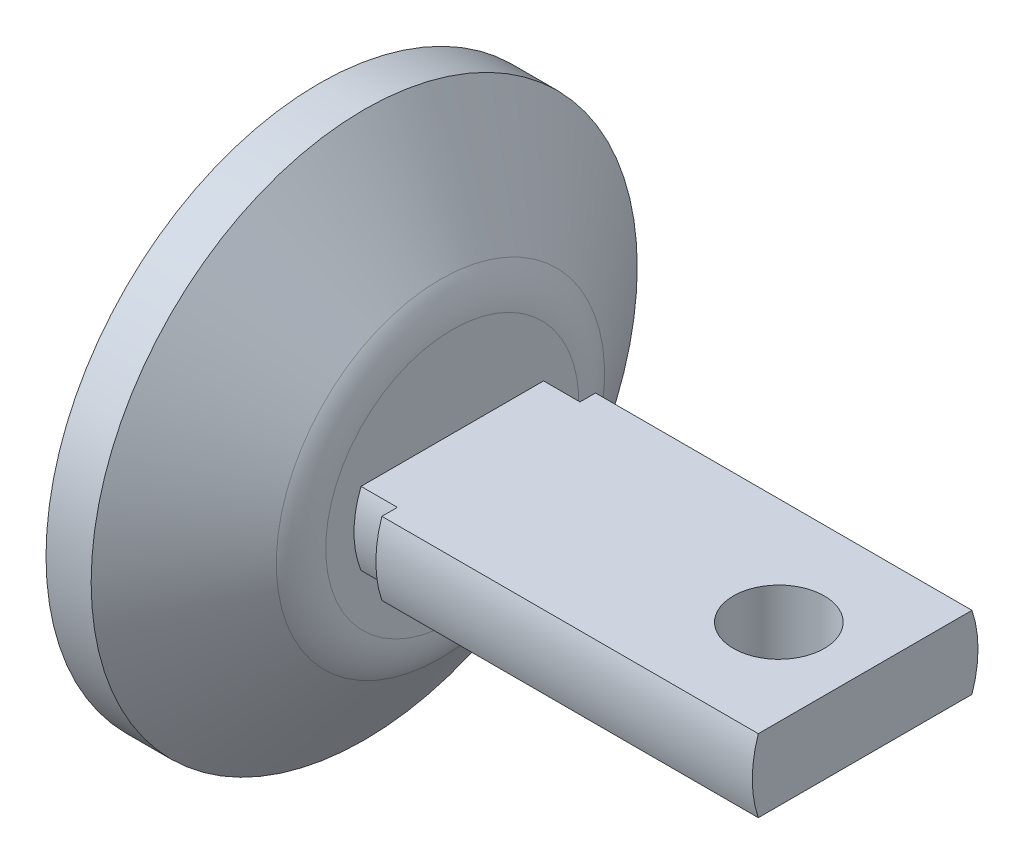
ISO-10303-21;
HEADER;
FILE_DESCRIPTION(('STEP AP214'),'2;1');
FILE_NAME('part.step','',(''),(''),'','','');
FILE_SCHEMA(('AUTOMOTIVE_DESIGN { 1 0 10303 214 1 1 1 1 }'));
ENDSEC;
DATA;
#1=APPLICATION_CONTEXT('core data for automotive mechanical design processes');
#2=APPLICATION_PROTOCOL_DEFINITION('international standard','automotive_design',2000,#1);
#3=PRODUCT_CONTEXT('',#1,'mechanical');
#4=PRODUCT('Part','Part','',(#3));
#5=PRODUCT_RELATED_PRODUCT_CATEGORY('part','',(#4));
#6=PRODUCT_DEFINITION_FORMATION('','',#4);
#7=PRODUCT_DEFINITION_CONTEXT('part definition',#1,'design');
#8=PRODUCT_DEFINITION('design','',#6,#7);
#9=PRODUCT_DEFINITION_SHAPE('','',#8);
#10=(LENGTH_UNIT() NAMED_UNIT(*) SI_UNIT(.MILLI.,.METRE.));
#11=(NAMED_UNIT(*) PLANE_ANGLE_UNIT() SI_UNIT($,.RADIAN.));
#12=(NAMED_UNIT(*) SI_UNIT($,.STERADIAN.) SOLID_ANGLE_UNIT());
#13=UNCERTAINTY_MEASURE_WITH_UNIT(LENGTH_MEASURE(1.E-05),#10,'distance_accuracy_value','');
#14=(GEOMETRIC_REPRESENTATION_CONTEXT(3) GLOBAL_UNCERTAINTY_ASSIGNED_CONTEXT((#13)) GLOBAL_UNIT_ASSIGNED_CONTEXT((#10,
#11,#12)) REPRESENTATION_CONTEXT('',''));
#15=CARTESIAN_POINT('',(0.,0.,0.));
#16=DIRECTION('',(0.,0.,1.));
#17=DIRECTION('',(1.,0.,0.));
#18=AXIS2_PLACEMENT_3D('',#15,#16,#17);
#19=CARTESIAN_POINT('',(6.858,0.,0.));
#20=DIRECTION('',(1.,0.,0.));
#21=DIRECTION('',(0.,1.,0.));
#22=AXIS2_PLACEMENT_3D('',#19,#20,#21);
#23=PLANE('',#22);
#24=CARTESIAN_POINT('',(6.858,-0.553438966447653,-6.32583633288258));
#25=DIRECTION('',(-1.,0.,0.));
#26=DIRECTION('',(0.,-1.,0.));
#27=AXIS2_PLACEMENT_3D('',#24,#25,#26);
#28=CIRCLE('',#27,2.0193);
#29=CARTESIAN_POINT('',(6.858,-2.57273896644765,-6.32583633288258));
#30=VERTEX_POINT('',#29);
#31=EDGE_CURVE('E154',#30,#30,#28,.T.);
#32=ORIENTED_EDGE('',*,*,#31,.F.);
#33=EDGE_LOOP('',(#32));
#34=FACE_BOUND('',#33,.T.);
#35=CARTESIAN_POINT('',(6.858,0.,0.));
#36=DIRECTION('',(-1.,0.,0.));
#37=DIRECTION('',(0.,-1.,0.));
#38=AXIS2_PLACEMENT_3D('',#35,#36,#37);
#39=CIRCLE('',#38,9.525);
#40=CARTESIAN_POINT('',(6.858,-9.525,0.));
#41=VERTEX_POINT('',#40);
#42=EDGE_CURVE('E201',#41,#41,#39,.T.);
#43=ORIENTED_EDGE('',*,*,#42,.T.);
#44=EDGE_LOOP('',(#43));
#45=FACE_BOUND('',#44,.T.);
#46=ADVANCED_FACE('F35',(#34,#45),#23,.F.);
#47=CARTESIAN_POINT('',(6.858,0.,0.));
#48=DIRECTION('',(-1.,0.,0.));
#49=DIRECTION('',(0.,-1.,0.));
#50=AXIS2_PLACEMENT_3D('',#47,#48,#49);
#51=CYLINDRICAL_SURFACE('',#50,3.429);
#52=CARTESIAN_POINT('',(12.7762,0.,0.));
#53=DIRECTION('',(-1.,0.,0.));
#54=DIRECTION('',(0.,-1.,0.));
#55=AXIS2_PLACEMENT_3D('',#52,#53,#54);
#56=CIRCLE('',#55,3.429);
#57=CARTESIAN_POINT('',(12.7762,1.27000000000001,-3.18514379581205));
#58=VERTEX_POINT('',#57);
#59=CARTESIAN_POINT('',(12.7762,-1.26999999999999,-3.18514379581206));
#60=VERTEX_POINT('',#59);
#61=EDGE_CURVE('E212',#58,#60,#56,.T.);
#62=ORIENTED_EDGE('',*,*,#61,.T.);
#63=DIRECTION('',(-1.,0.,0.));
#64=VECTOR('',#63,1.);
#65=CARTESIAN_POINT('',(6.858,-1.26999999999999,-3.18514379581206));
#66=LINE('',#65,#64);
#67=CARTESIAN_POINT('',(11.5062,-1.26999999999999,-3.18514379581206));
#68=VERTEX_POINT('',#67);
#69=EDGE_CURVE('E192',#60,#68,#66,.T.);
#70=ORIENTED_EDGE('',*,*,#69,.T.);
#71=CARTESIAN_POINT('',(11.5062,0.,0.));
#72=DIRECTION('',(-1.,0.,0.));
#73=DIRECTION('',(0.,-1.,0.));
#74=AXIS2_PLACEMENT_3D('',#71,#72,#73);
#75=CIRCLE('',#74,3.429);
#76=CARTESIAN_POINT('',(11.5062,1.27000000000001,-3.18514379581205));
#77=VERTEX_POINT('',#76);
#78=EDGE_CURVE('E216',#77,#68,#75,.T.);
#79=ORIENTED_EDGE('',*,*,#78,.F.);
#80=DIRECTION('',(-1.,0.,0.));
#81=VECTOR('',#80,1.);
#82=CARTESIAN_POINT('',(6.858,1.27000000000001,-3.18514379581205));
#83=LINE('',#82,#81);
#84=EDGE_CURVE('E179',#58,#77,#83,.T.);
#85=ORIENTED_EDGE('',*,*,#84,.F.);
#86=EDGE_LOOP('',(#62,#70,#79,#85));
#87=FACE_BOUND('',#86,.T.);
#88=ADVANCED_FACE('F243',(#87),#51,.T.);
#89=CARTESIAN_POINT('',(11.5062,-1.27000000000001,3.18514379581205));
#90=VERTEX_POINT('',#89);
#91=CARTESIAN_POINT('',(11.5062,1.26999999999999,3.18514379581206));
#92=VERTEX_POINT('',#91);
#93=EDGE_CURVE('E217',#90,#92,#75,.T.);
#94=ORIENTED_EDGE('',*,*,#93,.F.);
#95=DIRECTION('',(-1.,0.,0.));
#96=VECTOR('',#95,1.);
#97=CARTESIAN_POINT('',(6.858,-1.27000000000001,3.18514379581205));
#98=LINE('',#97,#96);
#99=CARTESIAN_POINT('',(12.7762,-1.27000000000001,3.18514379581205));
#100=VERTEX_POINT('',#99);
#101=EDGE_CURVE('E187',#90,#100,#98,.F.);
#102=ORIENTED_EDGE('',*,*,#101,.T.);
#103=CARTESIAN_POINT('',(12.7762,1.26999999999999,3.18514379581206));
#104=VERTEX_POINT('',#103);
#105=EDGE_CURVE('E213',#100,#104,#56,.T.);
#106=ORIENTED_EDGE('',*,*,#105,.T.);
#107=DIRECTION('',(-1.,0.,0.));
#108=VECTOR('',#107,1.);
#109=CARTESIAN_POINT('',(6.858,1.26999999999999,3.18514379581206));
#110=LINE('',#109,#108);
#111=EDGE_CURVE('E174',#92,#104,#110,.F.);
#112=ORIENTED_EDGE('',*,*,#111,.F.);
#113=EDGE_LOOP('',(#94,#102,#106,#112));
#114=FACE_BOUND('',#113,.T.);
#115=ADVANCED_FACE('F253',(#114),#51,.T.);
#116=CARTESIAN_POINT('',(12.7762,3.429,0.));
#117=DIRECTION('',(1.,0.,0.));
#118=DIRECTION('',(0.,1.,0.));
#119=AXIS2_PLACEMENT_3D('',#116,#117,#118);
#120=PLANE('',#119);
#121=CARTESIAN_POINT('',(12.7762,0.,0.));
#122=DIRECTION('',(-1.,0.,0.));
#123=DIRECTION('',(0.,-1.,0.));
#124=AXIS2_PLACEMENT_3D('',#121,#122,#123);
#125=CIRCLE('',#124,3.937);
#126=CARTESIAN_POINT('',(12.7762,1.27000000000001,-3.72653579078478));
#127=VERTEX_POINT('',#126);
#128=CARTESIAN_POINT('',(12.7762,-1.26999999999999,-3.72653579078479));
#129=VERTEX_POINT('',#128);
#130=EDGE_CURVE('E208',#127,#129,#125,.T.);
#131=ORIENTED_EDGE('',*,*,#130,.T.);
#132=DIRECTION('',(0.,0.,1.));
#133=VECTOR('',#132,1.);
#134=CARTESIAN_POINT('',(12.7762,-1.27,0.));
#135=LINE('',#134,#133);
#136=EDGE_CURVE('E188',#129,#60,#135,.T.);
#137=ORIENTED_EDGE('',*,*,#136,.T.);
#138=ORIENTED_EDGE('',*,*,#61,.F.);
#139=DIRECTION('',(0.,0.,1.));
#140=VECTOR('',#139,1.);
#141=CARTESIAN_POINT('',(12.7762,1.27,0.));
#142=LINE('',#141,#140);
#143=EDGE_CURVE('E175',#127,#58,#142,.T.);
#144=ORIENTED_EDGE('',*,*,#143,.F.);
#145=EDGE_LOOP('',(#131,#137,#138,#144));
#146=FACE_BOUND('',#145,.T.);
#147=ADVANCED_FACE('F239',(#146),#120,.F.);
#148=ORIENTED_EDGE('',*,*,#105,.F.);
#149=CARTESIAN_POINT('',(12.7762,-1.27000000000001,3.72653579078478));
#150=VERTEX_POINT('',#149);
#151=EDGE_CURVE('E184',#100,#150,#135,.T.);
#152=ORIENTED_EDGE('',*,*,#151,.T.);
#153=CARTESIAN_POINT('',(12.7762,1.26999999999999,3.72653579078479));
#154=VERTEX_POINT('',#153);
#155=EDGE_CURVE('E209',#150,#154,#125,.T.);
#156=ORIENTED_EDGE('',*,*,#155,.T.);
#157=EDGE_CURVE('E172',#104,#154,#142,.T.);
#158=ORIENTED_EDGE('',*,*,#157,.F.);
#159=EDGE_LOOP('',(#148,#152,#156,#158));
#160=FACE_BOUND('',#159,.T.);
#161=ADVANCED_FACE('F257',(#160),#120,.F.);
#162=CARTESIAN_POINT('',(6.858,0.,0.));
#163=DIRECTION('',(-1.,0.,0.));
#164=DIRECTION('',(0.,-1.,0.));
#165=AXIS2_PLACEMENT_3D('',#162,#163,#164);
#166=CYLINDRICAL_SURFACE('',#165,3.937);
#167=CARTESIAN_POINT('',(25.908,0.,0.));
#168=DIRECTION('',(-1.,0.,0.));
#169=DIRECTION('',(0.,-1.,0.));
#170=AXIS2_PLACEMENT_3D('',#167,#168,#169);
#171=CIRCLE('',#170,3.937);
#172=CARTESIAN_POINT('',(25.908,1.27000000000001,-3.72653579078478));
#173=VERTEX_POINT('',#172);
#174=CARTESIAN_POINT('',(25.908,-1.26999999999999,-3.72653579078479));
#175=VERTEX_POINT('',#174);
#176=EDGE_CURVE('E204',#173,#175,#171,.T.);
#177=ORIENTED_EDGE('',*,*,#176,.T.);
#178=DIRECTION('',(-1.,0.,0.));
#179=VECTOR('',#178,1.);
#180=CARTESIAN_POINT('',(6.858,-1.26999999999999,-3.72653579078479));
#181=LINE('',#180,#179);
#182=EDGE_CURVE('E50',#175,#129,#181,.T.);
#183=ORIENTED_EDGE('',*,*,#182,.T.);
#184=ORIENTED_EDGE('',*,*,#130,.F.);
#185=DIRECTION('',(-1.,0.,0.));
#186=VECTOR('',#185,1.);
#187=CARTESIAN_POINT('',(6.858,1.27000000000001,-3.72653579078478));
#188=LINE('',#187,#186);
#189=EDGE_CURVE('E177',#173,#127,#188,.T.);
#190=ORIENTED_EDGE('',*,*,#189,.F.);
#191=EDGE_LOOP('',(#177,#183,#184,#190));
#192=FACE_BOUND('',#191,.T.);
#193=ADVANCED_FACE('F231',(#192),#166,.T.);
#194=ORIENTED_EDGE('',*,*,#155,.F.);
#195=DIRECTION('',(-1.,0.,0.));
#196=VECTOR('',#195,1.);
#197=CARTESIAN_POINT('',(6.858,-1.27000000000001,3.72653579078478));
#198=LINE('',#197,#196);
#199=CARTESIAN_POINT('',(25.908,-1.27000000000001,3.72653579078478));
#200=VERTEX_POINT('',#199);
#201=EDGE_CURVE('E181',#150,#200,#198,.F.);
#202=ORIENTED_EDGE('',*,*,#201,.T.);
#203=CARTESIAN_POINT('',(25.908,1.26999999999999,3.72653579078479));
#204=VERTEX_POINT('',#203);
#205=EDGE_CURVE('E205',#200,#204,#171,.T.);
#206=ORIENTED_EDGE('',*,*,#205,.T.);
#207=DIRECTION('',(-1.,0.,0.));
#208=VECTOR('',#207,1.);
#209=CARTESIAN_POINT('',(6.858,1.26999999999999,3.72653579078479));
#210=LINE('',#209,#208);
#211=EDGE_CURVE('E58',#154,#204,#210,.F.);
#212=ORIENTED_EDGE('',*,*,#211,.F.);
#213=EDGE_LOOP('',(#194,#202,#206,#212));
#214=FACE_BOUND('',#213,.T.);
#215=ADVANCED_FACE('F260',(#214),#166,.T.);
#216=CARTESIAN_POINT('',(25.908,0.,0.));
#217=DIRECTION('',(-1.,0.,0.));
#218=DIRECTION('',(0.,-1.,0.));
#219=AXIS2_PLACEMENT_3D('',#216,#217,#218);
#220=PLANE('',#219);
#221=ORIENTED_EDGE('',*,*,#205,.F.);
#222=DIRECTION('',(0.,0.,-1.));
#223=VECTOR('',#222,1.);
#224=CARTESIAN_POINT('',(25.908,-1.27,0.));
#225=LINE('',#224,#223);
#226=EDGE_CURVE('E43',#200,#175,#225,.T.);
#227=ORIENTED_EDGE('',*,*,#226,.T.);
#228=ORIENTED_EDGE('',*,*,#176,.F.);
#229=DIRECTION('',(0.,0.,-1.));
#230=VECTOR('',#229,1.);
#231=CARTESIAN_POINT('',(25.908,1.27,0.));
#232=LINE('',#231,#230);
#233=EDGE_CURVE('E223',#204,#173,#232,.T.);
#234=ORIENTED_EDGE('',*,*,#233,.F.);
#235=EDGE_LOOP('',(#221,#227,#228,#234));
#236=FACE_BOUND('',#235,.T.);
#237=ADVANCED_FACE('F228',(#236),#220,.F.);
#238=CARTESIAN_POINT('',(9.2202,0.,0.));
#239=DIRECTION('',(-1.,0.,0.));
#240=DIRECTION('',(0.,-1.,0.));
#241=AXIS2_PLACEMENT_3D('',#238,#239,#240);
#242=TOROIDAL_SURFACE('',#241,4.41495688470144,2.286);
#243=CARTESIAN_POINT('',(11.0927815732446,0.,0.));
#244=DIRECTION('',(-1.,0.,0.));
#245=DIRECTION('',(0.,-1.,0.));
#246=AXIS2_PLACEMENT_3D('',#243,#244,#245);
#247=CIRCLE('',#246,5.72615261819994);
#248=CARTESIAN_POINT('',(11.0927815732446,-5.72615261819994,0.));
#249=VERTEX_POINT('',#248);
#250=EDGE_CURVE('E195',#249,#249,#247,.T.);
#251=ORIENTED_EDGE('',*,*,#250,.F.);
#252=EDGE_LOOP('',(#251));
#253=FACE_BOUND('',#252,.T.);
#254=CARTESIAN_POINT('',(11.5062,0.,0.));
#255=DIRECTION('',(-1.,0.,0.));
#256=DIRECTION('',(0.,-1.,0.));
#257=AXIS2_PLACEMENT_3D('',#254,#255,#256);
#258=CIRCLE('',#257,4.41495688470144);
#259=CARTESIAN_POINT('',(11.5062,-4.41495688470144,0.));
#260=VERTEX_POINT('',#259);
#261=EDGE_CURVE('E220',#260,#260,#258,.T.);
#262=ORIENTED_EDGE('',*,*,#261,.T.);
#263=EDGE_LOOP('',(#262));
#264=FACE_BOUND('',#263,.T.);
#265=ADVANCED_FACE('F37',(#253,#264),#242,.T.);
#266=CARTESIAN_POINT('',(11.5062,4.41495688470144,0.));
#267=DIRECTION('',(-1.,0.,0.));
#268=DIRECTION('',(0.,-1.,0.));
#269=AXIS2_PLACEMENT_3D('',#266,#267,#268);
#270=PLANE('',#269);
#271=DIRECTION('',(0.,0.,1.));
#272=VECTOR('',#271,1.);
#273=CARTESIAN_POINT('',(11.5062,-1.27,0.));
#274=LINE('',#273,#272);
#275=EDGE_CURVE('E166',#68,#90,#274,.T.);
#276=ORIENTED_EDGE('',*,*,#275,.T.);
#277=ORIENTED_EDGE('',*,*,#93,.T.);
#278=DIRECTION('',(0.,0.,1.));
#279=VECTOR('',#278,1.);
#280=CARTESIAN_POINT('',(11.5062,1.27,0.));
#281=LINE('',#280,#279);
#282=EDGE_CURVE('E169',#77,#92,#281,.T.);
#283=ORIENTED_EDGE('',*,*,#282,.F.);
#284=ORIENTED_EDGE('',*,*,#78,.T.);
#285=EDGE_LOOP('',(#276,#277,#283,#284));
#286=FACE_BOUND('',#285,.T.);
#287=ORIENTED_EDGE('',*,*,#261,.F.);
#288=EDGE_LOOP('',(#287));
#289=FACE_BOUND('',#288,.T.);
#290=ADVANCED_FACE('F249',(#286,#289),#270,.F.);
#291=CARTESIAN_POINT('',(6.858,0.,0.));
#292=DIRECTION('',(-1.,0.,0.));
#293=DIRECTION('',(0.,-1.,0.));
#294=AXIS2_PLACEMENT_3D('',#291,#292,#293);
#295=CYLINDRICAL_SURFACE('',#294,9.525);
#296=ORIENTED_EDGE('',*,*,#42,.F.);
#297=EDGE_LOOP('',(#296));
#298=FACE_BOUND('',#297,.T.);
#299=CARTESIAN_POINT('',(8.4328,0.,0.));
#300=DIRECTION('',(-1.,0.,0.));
#301=DIRECTION('',(0.,-1.,0.));
#302=AXIS2_PLACEMENT_3D('',#299,#300,#301);
#303=CIRCLE('',#302,9.525);
#304=CARTESIAN_POINT('',(8.4328,-9.525,0.));
#305=VERTEX_POINT('',#304);
#306=EDGE_CURVE('E198',#305,#305,#303,.T.);
#307=ORIENTED_EDGE('',*,*,#306,.T.);
#308=EDGE_LOOP('',(#307));
#309=FACE_BOUND('',#308,.T.);
#310=ADVANCED_FACE('F288',(#298,#309),#295,.T.);
#311=CARTESIAN_POINT('',(11.0927815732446,0.,0.));
#312=DIRECTION('',(-1.,0.,0.));
#313=DIRECTION('',(0.,-1.,0.));
#314=AXIS2_PLACEMENT_3D('',#311,#312,#313);
#315=CONICAL_SURFACE('',#314,5.72615261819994,0.95993108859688);
#316=ORIENTED_EDGE('',*,*,#306,.F.);
#317=EDGE_LOOP('',(#316));
#318=FACE_BOUND('',#317,.T.);
#319=ORIENTED_EDGE('',*,*,#250,.T.);
#320=EDGE_LOOP('',(#319));
#321=FACE_BOUND('',#320,.T.);
#322=ADVANCED_FACE('F272',(#318,#321),#315,.T.);
#323=CARTESIAN_POINT('',(-2.86220979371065,1.27,0.));
#324=DIRECTION('',(0.,1.,0.));
#325=DIRECTION('',(0.,0.,1.));
#326=AXIS2_PLACEMENT_3D('',#323,#324,#325);
#327=PLANE('',#326);
#328=CARTESIAN_POINT('',(22.8981,1.27,0.));
#329=DIRECTION('',(0.,1.,0.));
#330=DIRECTION('',(0.,0.,1.));
#331=AXIS2_PLACEMENT_3D('',#328,#329,#330);
#332=CIRCLE('',#331,1.5875);
#333=CARTESIAN_POINT('',(22.8981,1.26999999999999,1.5875));
#334=VERTEX_POINT('',#333);
#335=EDGE_CURVE('E160',#334,#334,#332,.T.);
#336=ORIENTED_EDGE('',*,*,#335,.F.);
#337=EDGE_LOOP('',(#336));
#338=FACE_BOUND('',#337,.T.);
#339=ORIENTED_EDGE('',*,*,#84,.T.);
#340=ORIENTED_EDGE('',*,*,#282,.T.);
#341=ORIENTED_EDGE('',*,*,#111,.T.);
#342=ORIENTED_EDGE('',*,*,#157,.T.);
#343=ORIENTED_EDGE('',*,*,#211,.T.);
#344=ORIENTED_EDGE('',*,*,#233,.T.);
#345=ORIENTED_EDGE('',*,*,#189,.T.);
#346=ORIENTED_EDGE('',*,*,#143,.T.);
#347=EDGE_LOOP('',(#339,#340,#341,#342,#343,#344,#345,#346));
#348=FACE_BOUND('',#347,.T.);
#349=ADVANCED_FACE('F235',(#338,#348),#327,.T.);
#350=CARTESIAN_POINT('',(-2.86220979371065,-1.27,0.));
#351=DIRECTION('',(0.,1.,0.));
#352=DIRECTION('',(0.,0.,1.));
#353=AXIS2_PLACEMENT_3D('',#350,#351,#352);
#354=PLANE('',#353);
#355=CARTESIAN_POINT('',(22.8981,-1.27,0.));
#356=DIRECTION('',(0.,1.,0.));
#357=DIRECTION('',(0.,0.,1.));
#358=AXIS2_PLACEMENT_3D('',#355,#356,#357);
#359=CIRCLE('',#358,1.5875);
#360=CARTESIAN_POINT('',(22.8981,-1.27000000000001,1.58749999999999));
#361=VERTEX_POINT('',#360);
#362=EDGE_CURVE('E163',#361,#361,#359,.F.);
#363=ORIENTED_EDGE('',*,*,#362,.F.);
#364=EDGE_LOOP('',(#363));
#365=FACE_BOUND('',#364,.T.);
#366=ORIENTED_EDGE('',*,*,#136,.F.);
#367=ORIENTED_EDGE('',*,*,#182,.F.);
#368=ORIENTED_EDGE('',*,*,#226,.F.);
#369=ORIENTED_EDGE('',*,*,#201,.F.);
#370=ORIENTED_EDGE('',*,*,#151,.F.);
#371=ORIENTED_EDGE('',*,*,#101,.F.);
#372=ORIENTED_EDGE('',*,*,#275,.F.);
#373=ORIENTED_EDGE('',*,*,#69,.F.);
#374=EDGE_LOOP('',(#366,#367,#368,#369,#370,#371,#372,#373));
#375=FACE_BOUND('',#374,.T.);
#376=ADVANCED_FACE('F261',(#365,#375),#354,.F.);
#377=CARTESIAN_POINT('',(22.8981,-9.52600000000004,0.));
#378=DIRECTION('',(0.,1.,0.));
#379=DIRECTION('',(0.,0.,1.));
#380=AXIS2_PLACEMENT_3D('',#377,#378,#379);
#381=CYLINDRICAL_SURFACE('',#380,1.5875);
#382=ORIENTED_EDGE('',*,*,#335,.T.);
#383=EDGE_LOOP('',(#382));
#384=FACE_BOUND('',#383,.T.);
#385=ORIENTED_EDGE('',*,*,#362,.T.);
#386=EDGE_LOOP('',(#385));
#387=FACE_BOUND('',#386,.T.);
#388=ADVANCED_FACE('F263',(#384,#387),#381,.F.);
#389=CARTESIAN_POINT('',(0.,-0.553438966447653,-6.32583633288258));
#390=DIRECTION('',(1.,0.,0.));
#391=DIRECTION('',(0.,1.,0.));
#392=AXIS2_PLACEMENT_3D('',#389,#390,#391);
#393=CYLINDRICAL_SURFACE('',#392,2.0193);
#394=DIRECTION('',(1.,0.,0.));
#395=VECTOR('',#394,1.);
#396=CARTESIAN_POINT('',(0.,-0.377445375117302,-4.31422037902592));
#397=LINE('',#396,#395);
#398=CARTESIAN_POINT('',(0.,-0.377445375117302,-4.31422037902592));
#399=VERTEX_POINT('',#398);
#400=CARTESIAN_POINT('',(3.3528,-0.377445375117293,-4.31422037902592));
#401=VERTEX_POINT('',#400);
#402=EDGE_CURVE('E139',#399,#401,#397,.T.);
#403=ORIENTED_EDGE('',*,*,#402,.T.);
#404=CARTESIAN_POINT('',(3.3528,-0.553438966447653,-6.32583633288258));
#405=DIRECTION('',(-1.,0.,0.));
#406=DIRECTION('',(0.,-1.,0.));
#407=AXIS2_PLACEMENT_3D('',#404,#405,#406);
#408=CIRCLE('',#407,2.0193);
#409=CARTESIAN_POINT('',(3.3528,-0.729432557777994,-8.33745228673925));
#410=VERTEX_POINT('',#409);
#411=EDGE_CURVE('E123',#410,#401,#408,.T.);
#412=ORIENTED_EDGE('',*,*,#411,.F.);
#413=DIRECTION('',(1.,0.,0.));
#414=VECTOR('',#413,1.);
#415=CARTESIAN_POINT('',(0.,-0.729432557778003,-8.33745228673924));
#416=LINE('',#415,#414);
#417=CARTESIAN_POINT('',(0.,-0.729432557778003,-8.33745228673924));
#418=VERTEX_POINT('',#417);
#419=EDGE_CURVE('E158',#418,#410,#416,.T.);
#420=ORIENTED_EDGE('',*,*,#419,.F.);
#421=CARTESIAN_POINT('',(0.,-0.553438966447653,-6.32583633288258));
#422=DIRECTION('',(-1.,0.,0.));
#423=DIRECTION('',(0.,-1.,0.));
#424=AXIS2_PLACEMENT_3D('',#421,#422,#423);
#425=CIRCLE('',#424,2.0193);
#426=EDGE_CURVE('E146',#399,#418,#425,.T.);
#427=ORIENTED_EDGE('',*,*,#426,.F.);
#428=EDGE_LOOP('',(#403,#412,#420,#427));
#429=FACE_BOUND('',#428,.T.);
#430=ORIENTED_EDGE('',*,*,#31,.T.);
#431=EDGE_LOOP('',(#430));
#432=FACE_BOUND('',#431,.T.);
#433=ADVANCED_FACE('F143',(#429,#432),#393,.T.);
#434=CARTESIAN_POINT('',(0.,-0.729432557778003,-8.33745228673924));
#435=DIRECTION('',(0.,0.0871557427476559,0.996194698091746));
#436=DIRECTION('',(0.,-0.996194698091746,0.087155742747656));
#437=AXIS2_PLACEMENT_3D('',#434,#435,#436);
#438=PLANE('',#437);
#439=ORIENTED_EDGE('',*,*,#419,.T.);
#440=DIRECTION('',(0.,-0.996194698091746,0.087155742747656));
#441=VECTOR('',#440,1.);
#442=CARTESIAN_POINT('',(3.3528,-0.729432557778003,-8.33745228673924));
#443=LINE('',#442,#441);
#444=CARTESIAN_POINT('',(3.3528,-0.982466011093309,-8.31531472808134));
#445=VERTEX_POINT('',#444);
#446=EDGE_CURVE('E127',#410,#445,#443,.T.);
#447=ORIENTED_EDGE('',*,*,#446,.T.);
#448=DIRECTION('',(1.,0.,0.));
#449=VECTOR('',#448,1.);
#450=CARTESIAN_POINT('',(0.,-0.982466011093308,-8.31531472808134));
#451=LINE('',#450,#449);
#452=CARTESIAN_POINT('',(0.,-0.982466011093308,-8.31531472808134));
#453=VERTEX_POINT('',#452);
#454=EDGE_CURVE('E149',#453,#445,#451,.T.);
#455=ORIENTED_EDGE('',*,*,#454,.F.);
#456=DIRECTION('',(0.,-0.996194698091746,0.0871557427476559));
#457=VECTOR('',#456,1.);
#458=CARTESIAN_POINT('',(0.,-0.729432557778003,-8.33745228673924));
#459=LINE('',#458,#457);
#460=EDGE_CURVE('E399',#418,#453,#459,.T.);
#461=ORIENTED_EDGE('',*,*,#460,.F.);
#462=EDGE_LOOP('',(#439,#447,#455,#461));
#463=FACE_BOUND('',#462,.T.);
#464=ADVANCED_FACE('F360',(#463),#438,.F.);
#465=CARTESIAN_POINT('',(0.,-0.806472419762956,-6.30369877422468));
#466=DIRECTION('',(1.,0.,0.));
#467=DIRECTION('',(0.,1.,0.));
#468=AXIS2_PLACEMENT_3D('',#465,#466,#467);
#469=CYLINDRICAL_SURFACE('',#468,2.0193);
#470=ORIENTED_EDGE('',*,*,#454,.T.);
#471=CARTESIAN_POINT('',(3.3528,-0.806472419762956,-6.30369877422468));
#472=DIRECTION('',(-1.,0.,0.));
#473=DIRECTION('',(0.,-1.,0.));
#474=AXIS2_PLACEMENT_3D('',#471,#472,#473);
#475=CIRCLE('',#474,2.0193);
#476=CARTESIAN_POINT('',(3.3528,-0.630478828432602,-4.29208282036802));
#477=VERTEX_POINT('',#476);
#478=EDGE_CURVE('E132',#445,#477,#475,.T.);
#479=ORIENTED_EDGE('',*,*,#478,.T.);
#480=DIRECTION('',(1.,0.,0.));
#481=VECTOR('',#480,1.);
#482=CARTESIAN_POINT('',(0.,-0.630478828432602,-4.29208282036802));
#483=LINE('',#482,#481);
#484=CARTESIAN_POINT('',(0.,-0.630478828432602,-4.29208282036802));
#485=VERTEX_POINT('',#484);
#486=EDGE_CURVE('E142',#485,#477,#483,.T.);
#487=ORIENTED_EDGE('',*,*,#486,.F.);
#488=CARTESIAN_POINT('',(0.,-0.806472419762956,-6.30369877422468));
#489=DIRECTION('',(-1.,0.,0.));
#490=DIRECTION('',(0.,-1.,0.));
#491=AXIS2_PLACEMENT_3D('',#488,#489,#490);
#492=CIRCLE('',#491,2.0193);
#493=EDGE_CURVE('E151',#453,#485,#492,.T.);
#494=ORIENTED_EDGE('',*,*,#493,.F.);
#495=EDGE_LOOP('',(#470,#479,#487,#494));
#496=FACE_BOUND('',#495,.T.);
#497=ADVANCED_FACE('F371',(#496),#469,.T.);
#498=CARTESIAN_POINT('',(0.,-0.377445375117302,-4.31422037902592));
#499=DIRECTION('',(0.,-0.0871557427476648,-0.996194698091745));
#500=DIRECTION('',(0.,0.996194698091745,-0.0871557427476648));
#501=AXIS2_PLACEMENT_3D('',#498,#499,#500);
#502=PLANE('',#501);
#503=ORIENTED_EDGE('',*,*,#486,.T.);
#504=DIRECTION('',(0.,0.996194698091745,-0.0871557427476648));
#505=VECTOR('',#504,1.);
#506=CARTESIAN_POINT('',(3.3528,-0.377445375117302,-4.31422037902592));
#507=LINE('',#506,#505);
#508=EDGE_CURVE('E11',#477,#401,#507,.T.);
#509=ORIENTED_EDGE('',*,*,#508,.T.);
#510=ORIENTED_EDGE('',*,*,#402,.F.);
#511=DIRECTION('',(0.,0.996194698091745,-0.0871557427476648));
#512=VECTOR('',#511,1.);
#513=CARTESIAN_POINT('',(0.,-0.377445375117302,-4.31422037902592));
#514=LINE('',#513,#512);
#515=EDGE_CURVE('E147',#485,#399,#514,.T.);
#516=ORIENTED_EDGE('',*,*,#515,.F.);
#517=EDGE_LOOP('',(#503,#509,#510,#516));
#518=FACE_BOUND('',#517,.T.);
#519=ADVANCED_FACE('F137',(#518),#502,.F.);
#520=CARTESIAN_POINT('',(0.,-0.553438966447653,-6.32583633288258));
#521=DIRECTION('',(-1.,0.,0.));
#522=DIRECTION('',(0.,-1.,0.));
#523=AXIS2_PLACEMENT_3D('',#520,#521,#522);
#524=PLANE('',#523);
#525=ORIENTED_EDGE('',*,*,#426,.T.);
#526=ORIENTED_EDGE('',*,*,#460,.T.);
#527=ORIENTED_EDGE('',*,*,#493,.T.);
#528=ORIENTED_EDGE('',*,*,#515,.T.);
#529=EDGE_LOOP('',(#525,#526,#527,#528));
#530=FACE_BOUND('',#529,.T.);
#531=ADVANCED_FACE('F340',(#530),#524,.T.);
#532=CARTESIAN_POINT('',(3.3528,-0.553438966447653,-6.32583633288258));
#533=DIRECTION('',(-1.,0.,0.));
#534=DIRECTION('',(0.,-1.,0.));
#535=AXIS2_PLACEMENT_3D('',#532,#533,#534);
#536=PLANE('',#535);
#537=ORIENTED_EDGE('',*,*,#411,.T.);
#538=ORIENTED_EDGE('',*,*,#508,.F.);
#539=ORIENTED_EDGE('',*,*,#478,.F.);
#540=ORIENTED_EDGE('',*,*,#446,.F.);
#541=EDGE_LOOP('',(#537,#538,#539,#540));
#542=FACE_BOUND('',#541,.T.);
#543=ADVANCED_FACE('F124',(#542),#536,.F.);
#544=CLOSED_SHELL('',(#46,#88,#115,#147,#161,#193,#215,#237,#265,#290,#310,#322,#349,#376,#388,
#433,#464,#497,#519,#531,#543));
#545=MANIFOLD_SOLID_BREP('B2',#544);
#546=ADVANCED_BREP_SHAPE_REPRESENTATION('',(#18,#545),#14);
#547=SHAPE_DEFINITION_REPRESENTATION(#9,#546);
ENDSEC;
END-ISO-10303-21;
